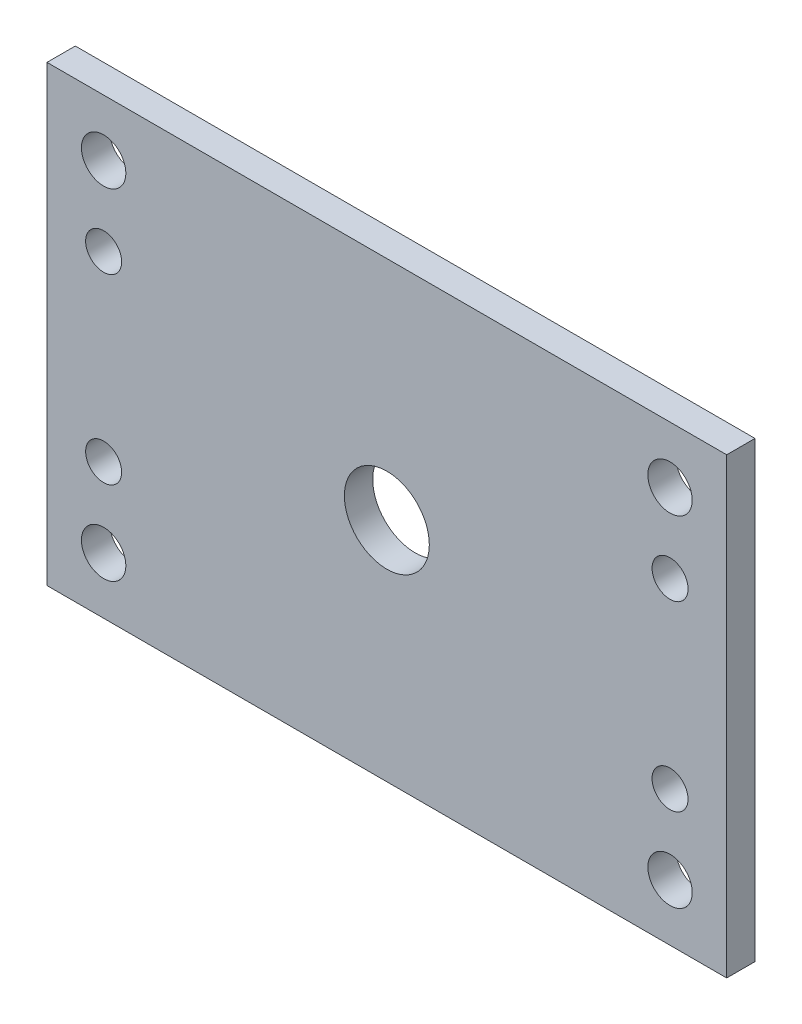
from build123d import *

# Parameters (mm, degrees)
SKETCH1_W           = 76.2
SKETCH1_H           = 50.8
SKETCH1_R           = 2.4892
SKETCH1_R_2         = 4.7625
SKETCH1_R_3         = 2.0193
BOSS_EXTRUDE1_DEPTH = 3.175


with BuildPart() as part:
    # Sketch1 → Boss-Extrude1 (new body)
    with BuildSketch(Plane.XY):
        with Locations((38.1, 25.4)):
            Rectangle(SKETCH1_W, SKETCH1_H)
        with Locations((6.35, 44.45)):
            Circle(SKETCH1_R, mode=Mode.SUBTRACT)
        with Locations((69.85, 44.45)):
            Circle(SKETCH1_R, mode=Mode.SUBTRACT)
        with Locations((69.85, 6.35)):
            Circle(SKETCH1_R, mode=Mode.SUBTRACT)
        with Locations((6.35, 6.35)):
            Circle(SKETCH1_R, mode=Mode.SUBTRACT)
        with Locations((38.1, 25.4)):
            Circle(SKETCH1_R_2, mode=Mode.SUBTRACT)
        with Locations((6.35, 35.6108)):
            Circle(SKETCH1_R_3, mode=Mode.SUBTRACT)
        with Locations((6.35, 15.1892)):
            Circle(SKETCH1_R_3, mode=Mode.SUBTRACT)
        with Locations((69.85, 15.1892)):
            Circle(SKETCH1_R_3, mode=Mode.SUBTRACT)
        with Locations((69.85, 35.6108)):
            Circle(SKETCH1_R_3, mode=Mode.SUBTRACT)
    extrude(amount=BOSS_EXTRUDE1_DEPTH)


solid = part.part
